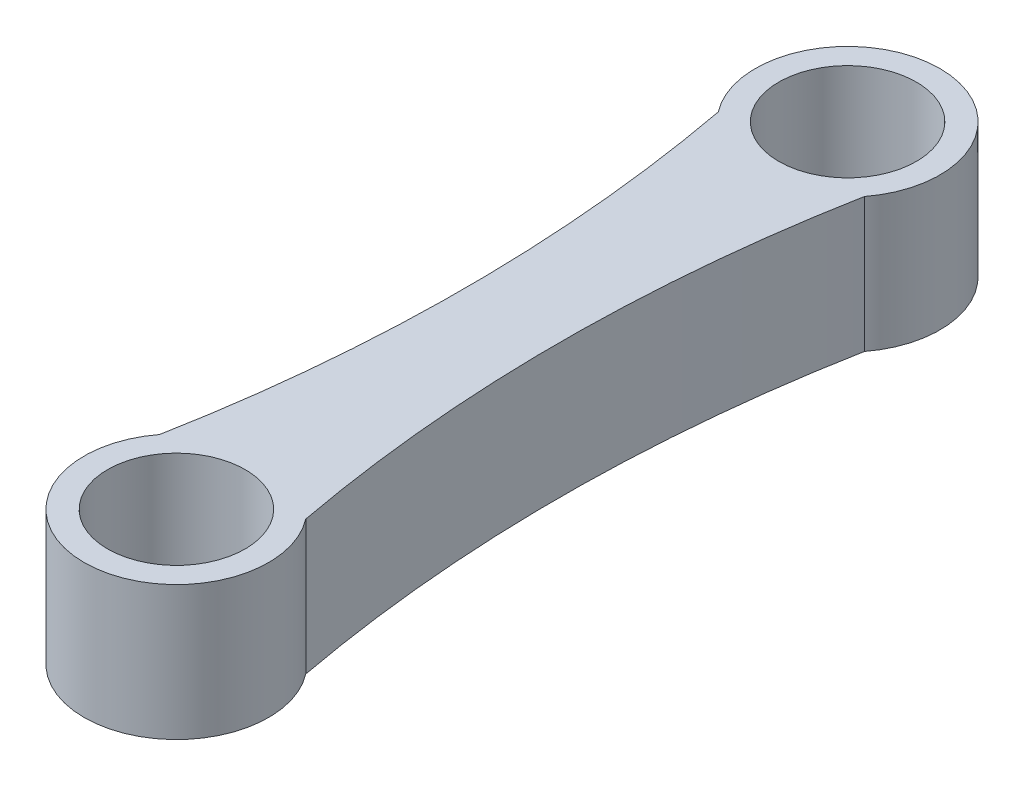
from build123d import *

# Parameters (mm, degrees)
BOSS_EXTRUDE3_DEPTH = 8
BOSS_EXTRUDE4_DEPTH = 2


with BuildPart() as part:
    # Sketch1 → Boss-Extrude3 (new body)
    with BuildSketch(Plane(origin=(0, 0, 0), x_dir=(1, 0, 0), z_dir=(0, 1, 0))):
        with BuildLine():
            Line((0, 27.282640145), (0, 28.682640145))
            ThreePointArc((0, 28.682640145), (-3.889087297, 27.071727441), (-5.5, 23.182640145))
            ThreePointArc((-5.5, 23.182640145), (-5.207009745, 21.411468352), (-4.35925472, 19.829000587))
            ThreePointArc((-4.35925472, 19.829000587), (-2.429504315, 18.248320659), (0, 17.682640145))
            Line((0, 17.682640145), (0, 19.082640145))
            ThreePointArc((0, 19.082640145), (-4.1, 23.182640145), (0, 27.282640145))
        make_face()
        with BuildLine():
            ThreePointArc((5.5, 23.182640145), (3.889087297, 27.071727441), (0, 28.682640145))
            Line((0, 28.682640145), (0, 27.282640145))
            ThreePointArc((0, 27.282640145), (2.899137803, 26.081777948), (4.1, 23.182640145))
            ThreePointArc((4.1, 23.182640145), (2.899137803, 20.283502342), (0, 19.082640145))
            Line((0, 19.082640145), (0, 17.682640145))
            ThreePointArc((0, 17.682640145), (2.429504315, 18.248320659), (4.35925472, 19.829000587))
            ThreePointArc((4.35925472, 19.829000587), (5.207009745, 21.411468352), (5.5, 23.182640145))
        make_face()
        with BuildLine():
            ThreePointArc((4.35925472, -13.463720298), (2.809536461, 3.182640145), (4.35925472, 19.829000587))
            ThreePointArc((4.35925472, 19.829000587), (2.429504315, 18.248320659), (0, 17.682640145))
            Line((0, 17.682640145), (0, -11.317359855))
            ThreePointArc((0, -11.317359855), (2.429504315, -11.88304037), (4.35925472, -13.463720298))
        make_face()
        with BuildLine():
            ThreePointArc((0, 17.682640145), (-2.429504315, 18.248320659), (-4.35925472, 19.829000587))
            ThreePointArc((-4.35925472, 19.829000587), (-2.809536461, 3.182640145), (-4.35925472, -13.463720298))
            ThreePointArc((-4.35925472, -13.463720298), (-2.429504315, -11.88304037), (0, -11.317359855))
            Line((0, -11.317359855), (0, 17.682640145))
        make_face()
        with BuildLine():
            ThreePointArc((0, -22.317359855), (3.889087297, -20.706447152), (5.5, -16.817359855))
            ThreePointArc((5.5, -16.817359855), (5.207009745, -15.046188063), (4.35925472, -13.463720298))
            ThreePointArc((4.35925472, -13.463720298), (2.429504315, -11.88304037), (0, -11.317359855))
            Line((0, -11.317359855), (0, -12.717359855))
            ThreePointArc((0, -12.717359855), (2.899137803, -13.918222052), (4.1, -16.817359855))
            ThreePointArc((4.1, -16.817359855), (2.899137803, -19.716497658), (0, -20.917359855))
            Line((0, -20.917359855), (0, -22.317359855))
        make_face()
        with BuildLine():
            ThreePointArc((-4.35925472, -13.463720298), (-5.207009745, -15.046188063), (-5.5, -16.817359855))
            ThreePointArc((-5.5, -16.817359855), (-3.889087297, -20.706447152), (0, -22.317359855))
            Line((0, -22.317359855), (0, -20.917359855))
            ThreePointArc((0, -20.917359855), (-4.1, -16.817359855), (0, -12.717359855))
            Line((0, -12.717359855), (0, -11.317359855))
            ThreePointArc((0, -11.317359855), (-2.429504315, -11.88304037), (-4.35925472, -13.463720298))
        make_face()
    extrude(amount=BOSS_EXTRUDE3_DEPTH)

    # Sketch1_7 → Boss-Extrude4 (add)
    with BuildSketch(Plane(origin=(0, 0, 0), x_dir=(1, 0, 0), z_dir=(0, 1, 0))):
        with BuildLine():
            ThreePointArc((4.1, 23.182640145), (2.899137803, 26.081777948), (0, 27.282640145))
            Line((0, 27.282640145), (0, 25.182640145))
            ThreePointArc((0, 25.182640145), (1.414213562, 24.596853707), (2, 23.182640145))
            ThreePointArc((2, 23.182640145), (1.414213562, 21.768426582), (0, 21.182640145))
            Line((0, 21.182640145), (0, 19.082640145))
            ThreePointArc((0, 19.082640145), (2.899137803, 20.283502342), (4.1, 23.182640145))
        make_face()
        with BuildLine():
            Line((0, 25.182640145), (0, 27.282640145))
            ThreePointArc((0, 27.282640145), (-4.1, 23.182640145), (0, 19.082640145))
            Line((0, 19.082640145), (0, 21.182640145))
            ThreePointArc((0, 21.182640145), (-2, 23.182640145), (0, 25.182640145))
        make_face()
        with BuildLine():
            ThreePointArc((4.1, 23.182640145), (2.899137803, 26.081777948), (0, 27.282640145))
            Line((0, 27.282640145), (0, 25.182640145))
            ThreePointArc((0, 25.182640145), (1.414213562, 24.596853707), (2, 23.182640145))
            ThreePointArc((2, 23.182640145), (1.414213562, 21.768426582), (0, 21.182640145))
            Line((0, 21.182640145), (0, 19.082640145))
            ThreePointArc((0, 19.082640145), (2.899137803, 20.283502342), (4.1, 23.182640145))
        make_face()
        with BuildLine():
            Line((0, 25.182640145), (0, 27.282640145))
            ThreePointArc((0, 27.282640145), (-4.1, 23.182640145), (0, 19.082640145))
            Line((0, 19.082640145), (0, 21.182640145))
            ThreePointArc((0, 21.182640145), (-2, 23.182640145), (0, 25.182640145))
        make_face()
        with BuildLine():
            ThreePointArc((0, -12.717359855), (-4.1, -16.817359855), (0, -20.917359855))
            Line((0, -20.917359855), (0, -18.817359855))
            ThreePointArc((0, -18.817359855), (-2, -16.817359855), (0, -14.817359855))
            Line((0, -14.817359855), (0, -12.717359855))
        make_face()
        with BuildLine():
            Line((0, -18.817359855), (0, -20.917359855))
            ThreePointArc((0, -20.917359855), (2.899137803, -19.716497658), (4.1, -16.817359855))
            ThreePointArc((4.1, -16.817359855), (2.899137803, -13.918222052), (0, -12.717359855))
            Line((0, -12.717359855), (0, -14.817359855))
            ThreePointArc((0, -14.817359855), (1.414213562, -15.403146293), (2, -16.817359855))
            ThreePointArc((2, -16.817359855), (1.414213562, -18.231573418), (0, -18.817359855))
        make_face()
        with BuildLine():
            ThreePointArc((0, -12.717359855), (-4.1, -16.817359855), (0, -20.917359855))
            Line((0, -20.917359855), (0, -18.817359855))
            ThreePointArc((0, -18.817359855), (-2, -16.817359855), (0, -14.817359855))
            Line((0, -14.817359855), (0, -12.717359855))
        make_face()
        with BuildLine():
            Line((0, -18.817359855), (0, -20.917359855))
            ThreePointArc((0, -20.917359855), (2.899137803, -19.716497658), (4.1, -16.817359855))
            ThreePointArc((4.1, -16.817359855), (2.899137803, -13.918222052), (0, -12.717359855))
            Line((0, -12.717359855), (0, -14.817359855))
            ThreePointArc((0, -14.817359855), (1.414213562, -15.403146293), (2, -16.817359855))
            ThreePointArc((2, -16.817359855), (1.414213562, -18.231573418), (0, -18.817359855))
        make_face()
    extrude(amount=BOSS_EXTRUDE4_DEPTH)


solid = part.part
